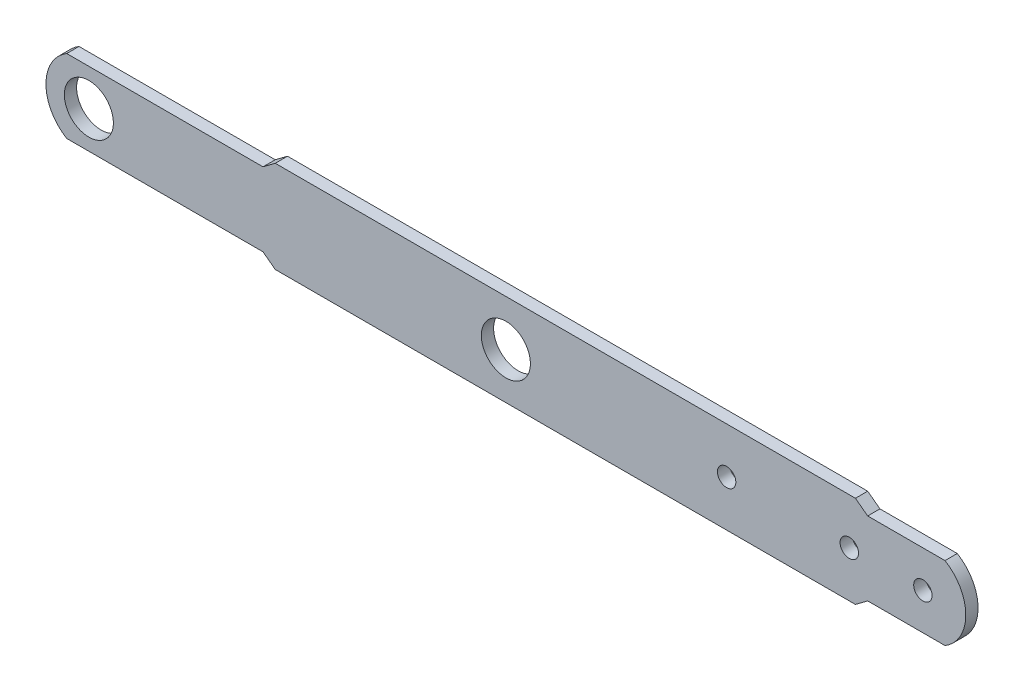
from build123d import *

# Parameters (mm, degrees)
ESQUISSE1_R      = 1.5
ESQUISSE1_R_2    = 4
EXTRUSION1_DEPTH = 2


with BuildPart() as part:
    # Esquisse1 → Extrusion1 (new body)
    with BuildSketch(Plane.XY):
        with BuildLine():
            Line((71.605551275, 6), (59, 6))
            Line((59, 6), (57, 7.5))
            Line((57, 7.5), (-37.605551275, 7.5))
            Line((-37.605551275, 7.5), (-39.605551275, 6))
            Line((-39.605551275, 6), (-71.605551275, 6))
            ThreePointArc((-71.605551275, 6), (-75, 0), (-71.605551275, -6))
            Line((-71.605551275, -6), (-39.605551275, -6))
            Line((-39.605551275, -6), (-37.605551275, -7.5))
            Line((-37.605551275, -7.5), (57, -7.5))
            Line((57, -7.5), (59, -6))
            Line((59, -6), (71.605551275, -6))
            ThreePointArc((71.605551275, -6), (75, 0), (71.605551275, 6))
        make_face()
        with Locations((68, 0)):
            Circle(ESQUISSE1_R, mode=Mode.SUBTRACT)
        with Locations(Location((-68, 0, 0), (0, 0, 180))):
            Circle(ESQUISSE1_R_2, mode=Mode.SUBTRACT)
        Circle(ESQUISSE1_R_2, mode=Mode.SUBTRACT)
        with Locations((56, 0)):
            Circle(ESQUISSE1_R, mode=Mode.SUBTRACT)
        with Locations((36, 0)):
            Circle(ESQUISSE1_R, mode=Mode.SUBTRACT)
    extrude(amount=EXTRUSION1_DEPTH)


solid = part.part
